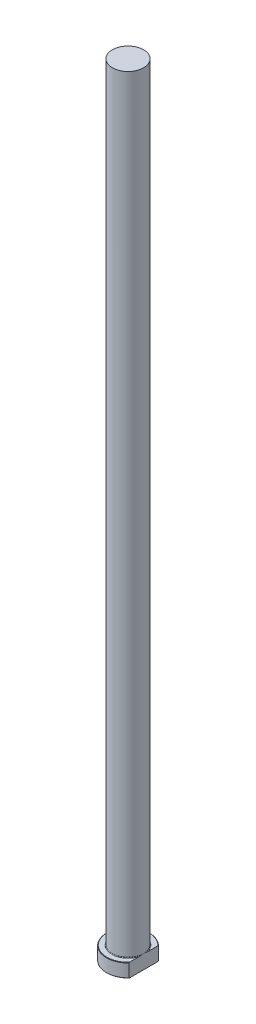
from build123d import *
from build123d.topology import SkipClean

# Parameters (mm, degrees)
CHAMFER1_SIZE = 0.2
FILLET1_R     = 0.3
KEY_DEPTH     = 401.302385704


with BuildPart() as part:
    # Sketch1 → Revolve1 (revolve)
    with BuildSketch(Plane.XY, mode=Mode.PRIVATE) as revolve1_sk:
        Polygon((0, 0), (-11, 0), (-11, 7), (-8, 7), (-8, 400), (0, 400), align=None)
    revolve(revolve1_sk.sketch.rotate(Axis((0, 259.958771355, 0), (0, -1, 0)), 270), axis=Axis((0, 259.958771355, 0), (0, -1, 0)))

    # Chamfer1
    chamfer1_edges = [part.edges().sort_by_distance(p)[0] for p in [
        (0, 7, -11),
        (0, 0, -11),
    ]]
    chamfer(chamfer1_edges, length=CHAMFER1_SIZE)

    # Fillet1
    fillet1_edges = [part.edges().sort_by_distance(p)[0] for p in [
        (0, 7, -8),
    ]]
    fillet(fillet1_edges, radius=FILLET1_R)

    # Sketch2 → KEY (cut, through all)
    with SkipClean():  # the faces are left unmerged after this step: merging them gives an invalid solid
        with BuildSketch(Plane(origin=(0, 0, 0), x_dir=(1, 0, 0), z_dir=(0, 1, 0))):
            with BuildLine():
                Line((8, 7.549834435), (8, -7.549834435))
                ThreePointArc((8, -7.549834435), (11, 0), (8, 7.549834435))
            make_face()
        extrude(amount=KEY_DEPTH, mode=Mode.SUBTRACT)


solid = part.part
